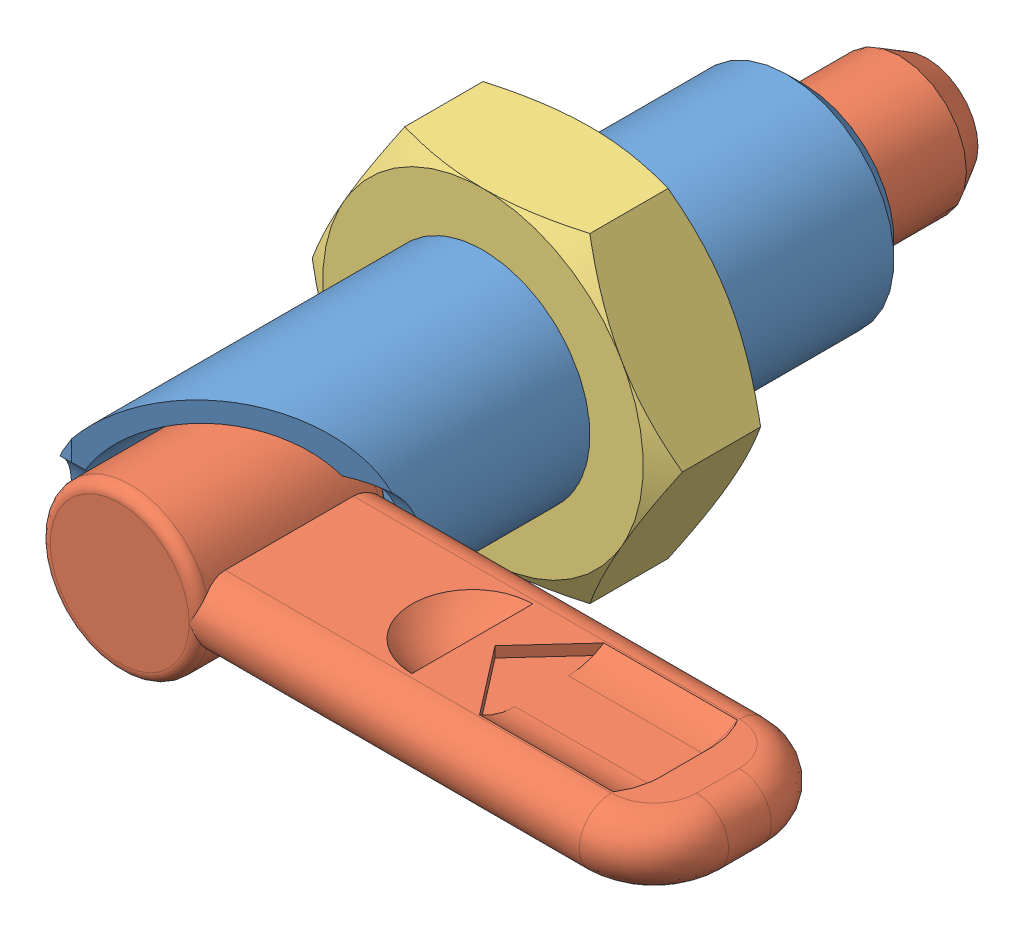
SolidWorks assembly GDX16LW-10N-SUS.sldasm, configuration Default (file format 15000). Lengths in mm.
Overall size (56.4 32.79 61.21).
3 component instances, 3 part files, 0 mates.
Components (placement in the parent):
- GDX16LW-10N-SUS_01-1: GDX16LW-10N-SUS_01.SLDPRT [ﾃﾞﾌｫﾙﾄ] x (1 0 0) z (0 -1 0) size (16.02 50.53 16.01)
- GDX16LW-10N-SUS_02-1: GDX16LW-10N-SUS_02.SLDPRT [ﾃﾞﾌｫﾙﾄ] x (1 0 0) z (0 -1 0) size (46 61.21 12)
- GDX16LW-10N-SUS_03-1: GDX16LW-10N-SUS_03.SLDPRT [ﾃﾞﾌｫﾙﾄ] at (0 0 16) x (0 0 1) z (0 1 0) size (8.01 32.79 32.79)
